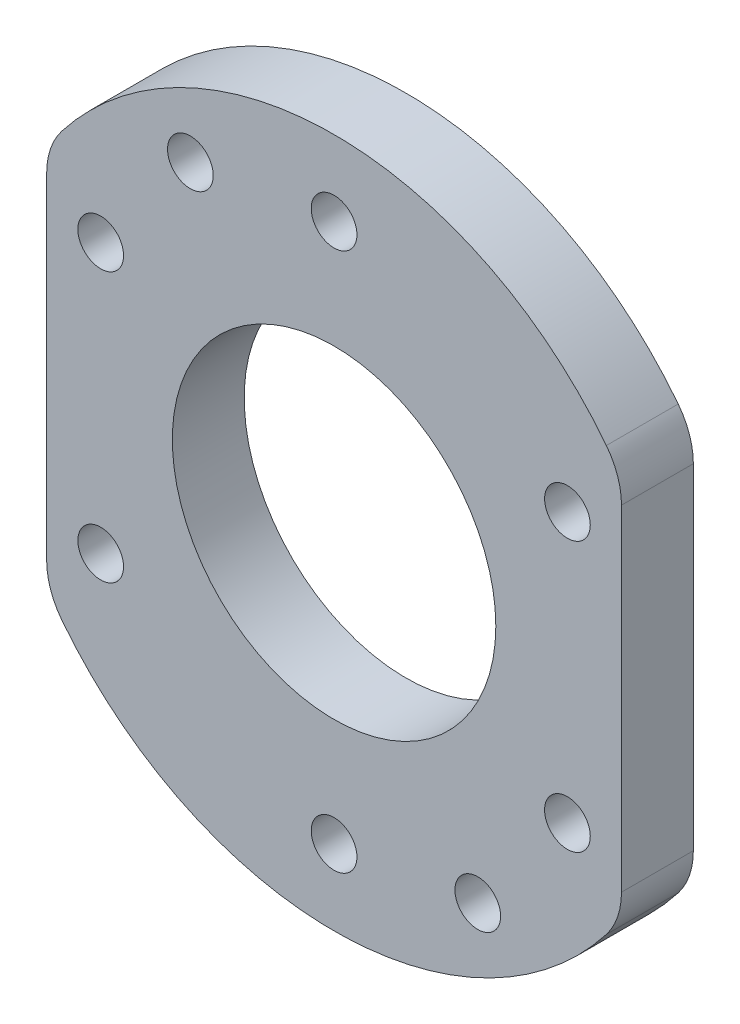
from build123d import *

# Parameters (mm, degrees)
BOSS_EXTRUDE1_DEPTH        = 6.35
TAP_DRILL_FOR_10_32_TAP3_D = 4.0386
CIRPATTERN1_COUNT          = 6
FILLET1_R                  = 6.35
SKETCH10_R                 = 14.29385
CUT_EXTRUDE2_DEPTH         = 6.35
F_10_32_TAPPED_HOLE1_D     = 4.0386


with BuildPart() as part:
    # Sketch1 → Boss-Extrude1 (new body)
    with BuildSketch(Plane.XY):
        with BuildLine():
            ThreePointArc((25.4, 16.848453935), (0, 30.48), (-25.4, 16.848453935))
            Line((-25.4, 16.848453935), (-25.4, -16.848453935))
            ThreePointArc((-25.4, -16.848453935), (0, -30.48), (25.4, -16.848453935))
            Line((25.4, -16.848453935), (25.4, 16.848453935))
        make_face()
        Polygon((-3.666174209, -6.35), (-7.332348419, 0), (-3.666174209, 6.35), (3.666174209, 6.35), (7.332348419, 0), (3.666174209, -6.35), align=None, mode=Mode.SUBTRACT)
    extrude(amount=BOSS_EXTRUDE1_DEPTH)

    # Tap Drill for _10-32 Tap3 (through all)
    with Locations(Plane(origin=(0, 23.8125, 6.35), x_dir=(1, 0, 0), z_dir=(0, 0, 1))):
        with Locations((0, 0)):
            tap_drill_for_10_32_tap3 = Hole(TAP_DRILL_FOR_10_32_TAP3_D / 2)

    # CirPattern1: Tap Drill for _10-32 Tap3 ×6 about axis
    cirpattern1_axis = Axis((0, 0, 0), (0, 0, 1))
    for i in range(1, CIRPATTERN1_COUNT):
        add(tap_drill_for_10_32_tap3.rotate(cirpattern1_axis, i * 360 / CIRPATTERN1_COUNT), mode=Mode.SUBTRACT)

    # Fillet1
    fillet1_edges = [part.edges().sort_by_distance(p)[0] for p in [
        (25.4, -16.848453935, 3.175),
        (-25.4, -16.848453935, 3.175),
        (-25.4, 16.848453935, 3.175),
        (25.4, 16.848453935, 3.175),
    ]]
    fillet(fillet1_edges, radius=FILLET1_R)

    # Sketch10 → Cut-Extrude2 (cut)
    with BuildSketch(Plane.XY.offset(6.35)):
        Circle(SKETCH10_R)
    extrude(amount=-CUT_EXTRUDE2_DEPTH, mode=Mode.SUBTRACT)

    # 10-32 Tapped Hole1 (through all)
    with Locations(Plane(origin=(-12.7, 21.997045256, 6.35), x_dir=(1, 0, 0), z_dir=(0, 0, 1))):
        with Locations((0, 0), (25.4, -43.994090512)):
            Hole(F_10_32_TAPPED_HOLE1_D / 2)


solid = part.part
